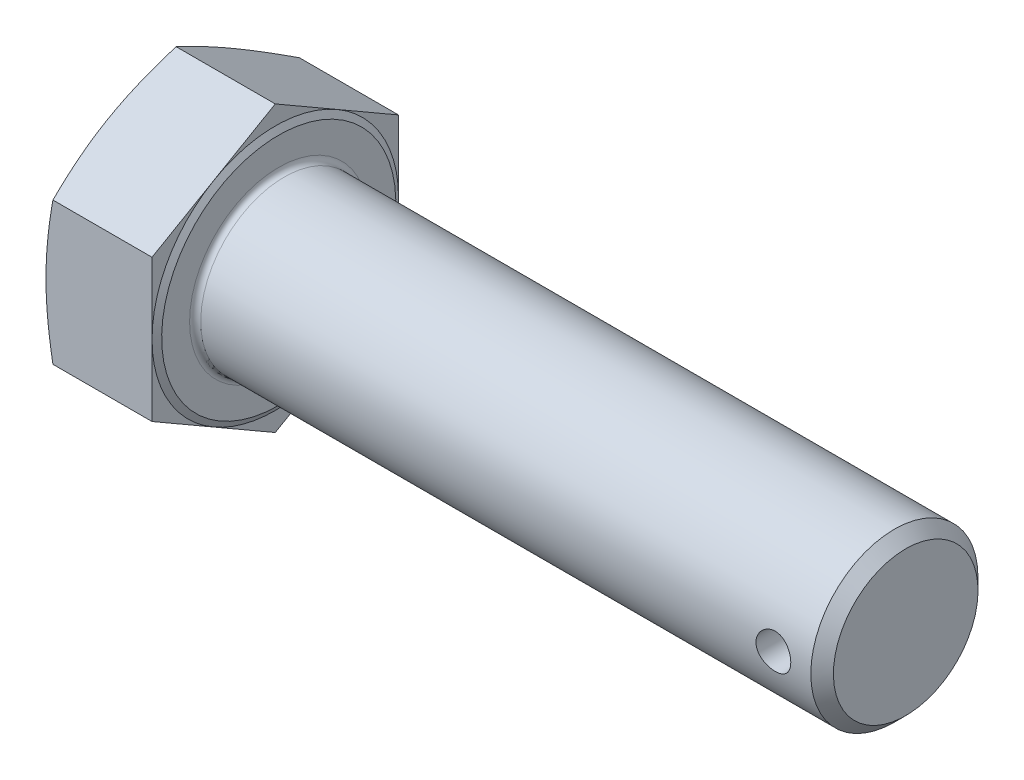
from build123d import *

# Parameters (mm, degrees)
BASEHEAD_DEPTH  = 15.22
SKETCH3_R       = 12
BASEBODY_DEPTH  = 90
CHAMFER1_SIZE   = 1.624
HEADFILLET_R    = 0.8
HOLE_DEPTH      = 110.118754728
HOLE_DEPTH_BACK = 110.118754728
SKETCH5_R       = 2.5


with BuildPart() as part:
    # Sketch-BaseHead → BaseHead (new body)
    with BuildSketch(Plane(origin=(0, 0, 0), x_dir=(0, 0, -1), z_dir=(1, 0, 0))):
        Polygon((0, -20.426652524), (17.69, -10.213326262), (17.69, 10.213326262), (0, 20.426652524), (-17.69, 10.213326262), (-17.69, -10.213326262), align=None)
    extrude(amount=BASEHEAD_DEPTH)

    # Sketch4 → HeadChamfer (revolve, cut)
    with BuildSketch(Plane(origin=(-0.264637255, -5.916896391, 0), x_dir=(0, 1, 0), z_dir=(0, 0, 1))):
        Polygon((26.343548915, -0.264637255), (23.606896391, -0.264637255), (26.343548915, -1.260697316), align=None)
    revolve(axis=Axis((-4.001564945, 0, 0), (1, 0, 0)), mode=Mode.SUBTRACT)

    # Sketch1 → Revolve1 (revolve)
    with BuildSketch(Plane(origin=(0, 0, 0), x_dir=(1, 0, 0), z_dir=(0, 1, 0)), mode=Mode.PRIVATE) as revolve1_sk:
        Polygon((15.22, 0), (15.72, 0), (15.72, 16.805), (15.22, 17.69), align=None)
    revolve(revolve1_sk.sketch.rotate(Axis((-4.001564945, 0, 0), (1, 0, 0)), 270), axis=Axis((-4.001564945, 0, 0), (1, 0, 0)))

    # Sketch3 → BaseBody (add)
    with BuildSketch(Plane(origin=(15.72, 0, 0), x_dir=(0, 0, -1), z_dir=(1, 0, 0))):
        with Locations(Location((0, 0, 0), (0, 0, 270))):
            Circle(SKETCH3_R)
    extrude(amount=BASEBODY_DEPTH)

    # Chamfer1
    chamfer1_edges = [part.edges().sort_by_distance(p)[0] for p in [
        (105.72, 12, 0),
    ]]
    chamfer(chamfer1_edges, length=CHAMFER1_SIZE)

    # HeadFillet
    headfillet_edges = [part.edges().sort_by_distance(p)[0] for p in [
        (15.72, 12, 0),
    ]]
    fillet(headfillet_edges, radius=HEADFILLET_R)

    # Sketch5 → Hole (cut, two sides: drawn at the far end of the back side and taken through both)
    with BuildSketch(Plane.XY.offset(-HOLE_DEPTH_BACK)):
        with Locations((98.72, 0)):
            Circle(SKETCH5_R)
    extrude(amount=HOLE_DEPTH + HOLE_DEPTH_BACK, mode=Mode.SUBTRACT)


solid = part.part
